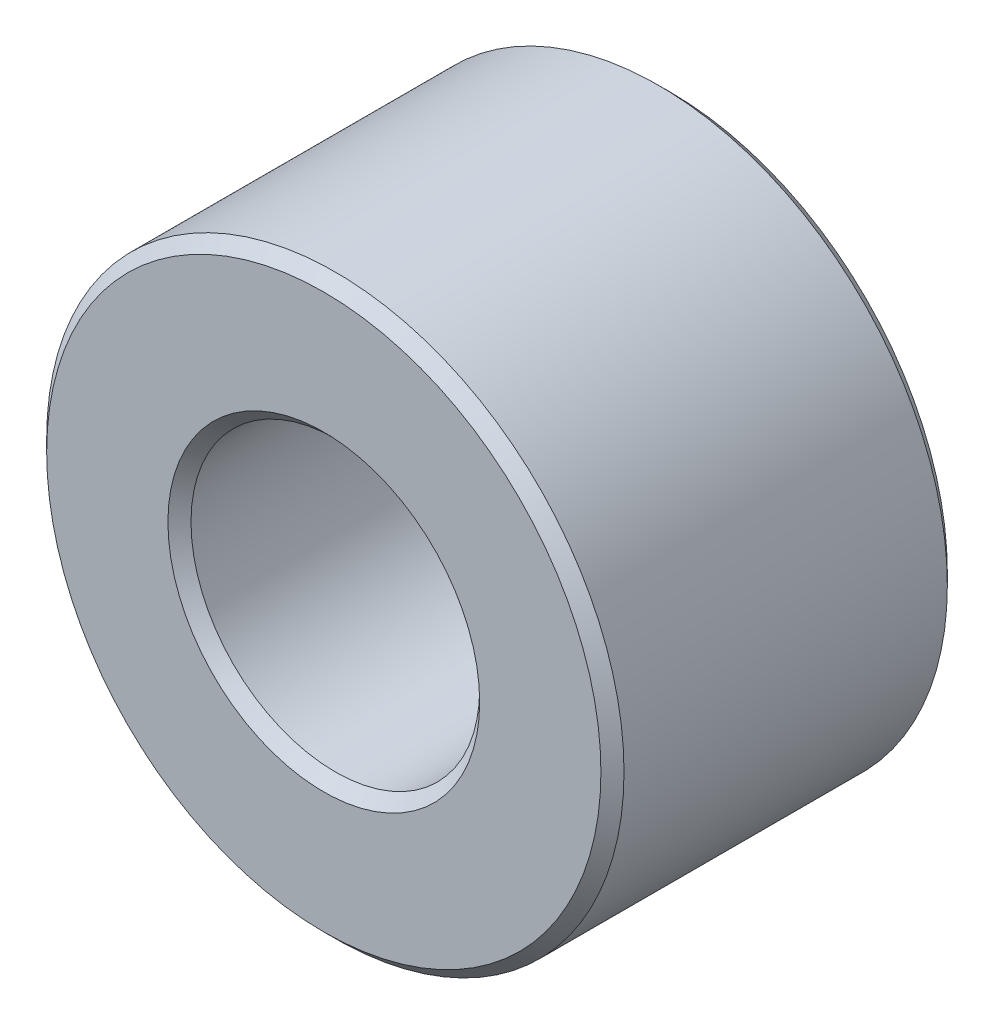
from build123d import *

# Parameters (mm, degrees)
SKETCH1_R           = 2.5
SKETCH1_R_2         = 1.25
BOSS_EXTRUDE2_DEPTH = 1.5
CHAMFER3_SIZE       = 0.1


with BuildPart() as part:
    # Sketch1 → Boss-Extrude2 (new, symmetric)
    with BuildSketch(Plane.XY):
        Circle(SKETCH1_R)
        Circle(SKETCH1_R_2, mode=Mode.SUBTRACT)
    extrude(amount=BOSS_EXTRUDE2_DEPTH, both=True)

    # Chamfer3
    chamfer3_edges = [part.edges().sort_by_distance(p)[0] for p in [
        (-2.5, 0, -1.5),
        (-2.5, 0, 1.5),
        (-1.25, 0, -1.5),
        (-1.25, 0, 1.5),
    ]]
    chamfer(chamfer3_edges, length=CHAMFER3_SIZE)


solid = part.part
